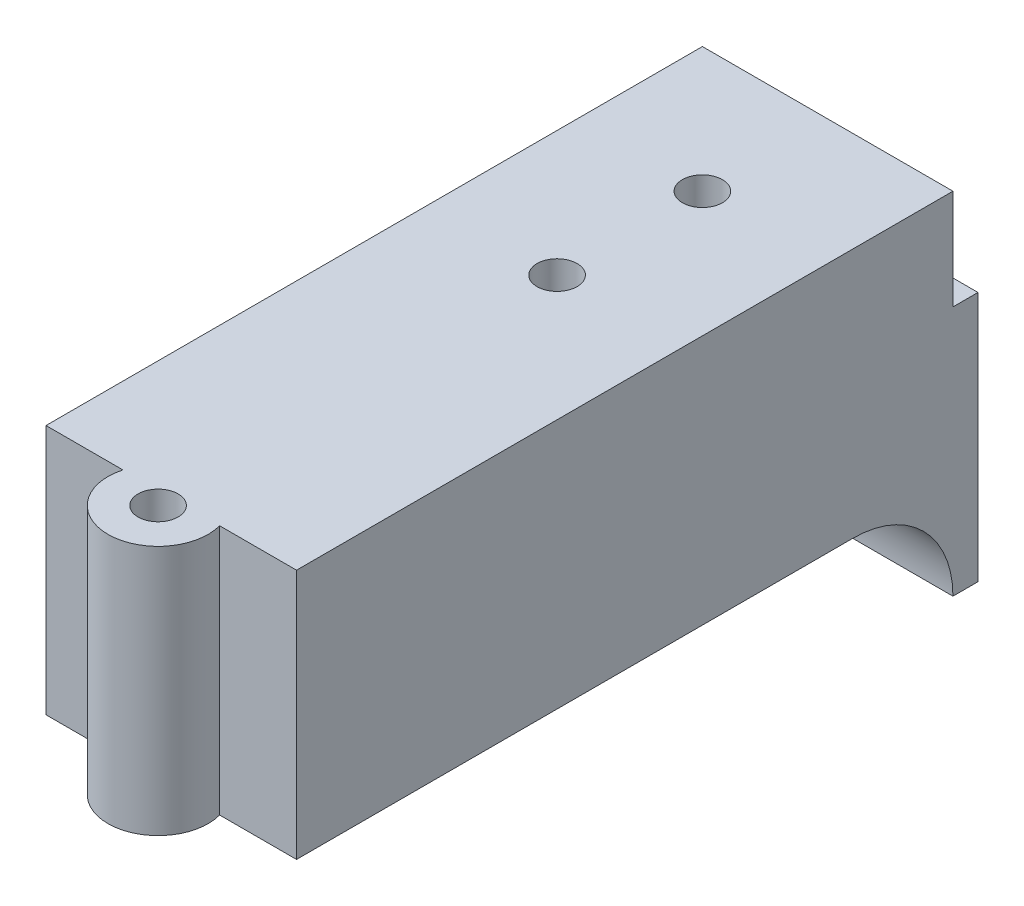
ISO-10303-21;
HEADER;
FILE_DESCRIPTION(('STEP AP214'),'2;1');
FILE_NAME('part.step','',(''),(''),'','','');
FILE_SCHEMA(('AUTOMOTIVE_DESIGN { 1 0 10303 214 1 1 1 1 }'));
ENDSEC;
DATA;
#1=APPLICATION_CONTEXT('core data for automotive mechanical design processes');
#2=APPLICATION_PROTOCOL_DEFINITION('international standard','automotive_design',2000,#1);
#3=PRODUCT_CONTEXT('',#1,'mechanical');
#4=PRODUCT('Part','Part','',(#3));
#5=PRODUCT_RELATED_PRODUCT_CATEGORY('part','',(#4));
#6=PRODUCT_DEFINITION_FORMATION('','',#4);
#7=PRODUCT_DEFINITION_CONTEXT('part definition',#1,'design');
#8=PRODUCT_DEFINITION('design','',#6,#7);
#9=PRODUCT_DEFINITION_SHAPE('','',#8);
#10=(LENGTH_UNIT() NAMED_UNIT(*) SI_UNIT(.MILLI.,.METRE.));
#11=(NAMED_UNIT(*) PLANE_ANGLE_UNIT() SI_UNIT($,.RADIAN.));
#12=(NAMED_UNIT(*) SI_UNIT($,.STERADIAN.) SOLID_ANGLE_UNIT());
#13=UNCERTAINTY_MEASURE_WITH_UNIT(LENGTH_MEASURE(1.E-05),#10,'distance_accuracy_value','');
#14=(GEOMETRIC_REPRESENTATION_CONTEXT(3) GLOBAL_UNCERTAINTY_ASSIGNED_CONTEXT((#13)) GLOBAL_UNIT_ASSIGNED_CONTEXT((#10,
#11,#12)) REPRESENTATION_CONTEXT('',''));
#15=CARTESIAN_POINT('',(0.,0.,0.));
#16=DIRECTION('',(0.,0.,1.));
#17=DIRECTION('',(1.,0.,0.));
#18=AXIS2_PLACEMENT_3D('',#15,#16,#17);
#19=CARTESIAN_POINT('',(25.,50.,58.63));
#20=DIRECTION('',(0.,-1.,0.));
#21=DIRECTION('',(0.,0.,-1.));
#22=AXIS2_PLACEMENT_3D('',#19,#20,#21);
#23=CYLINDRICAL_SURFACE('',#22,4.);
#24=CARTESIAN_POINT('',(25.,50.,58.63));
#25=DIRECTION('',(0.,-1.,0.));
#26=DIRECTION('',(0.,0.,-1.));
#27=AXIS2_PLACEMENT_3D('',#24,#25,#26);
#28=CIRCLE('',#27,4.);
#29=CARTESIAN_POINT('',(25.,50.,54.63));
#30=VERTEX_POINT('',#29);
#31=EDGE_CURVE('E253',#30,#30,#28,.T.);
#32=ORIENTED_EDGE('',*,*,#31,.F.);
#33=EDGE_LOOP('',(#32));
#34=FACE_BOUND('',#33,.T.);
#35=CARTESIAN_POINT('',(25.,10.,58.63));
#36=DIRECTION('',(0.,-1.,0.));
#37=DIRECTION('',(0.,0.,-1.));
#38=AXIS2_PLACEMENT_3D('',#35,#36,#37);
#39=CIRCLE('',#38,4.);
#40=CARTESIAN_POINT('',(25.,10.,54.63));
#41=VERTEX_POINT('',#40);
#42=EDGE_CURVE('E12',#41,#41,#39,.F.);
#43=ORIENTED_EDGE('',*,*,#42,.F.);
#44=EDGE_LOOP('',(#43));
#45=FACE_BOUND('',#44,.T.);
#46=ADVANCED_FACE('F46',(#34,#45),#23,.F.);
#47=CARTESIAN_POINT('',(0.,50.,56.));
#48=DIRECTION('',(0.,0.,-1.));
#49=DIRECTION('',(-1.,0.,0.));
#50=AXIS2_PLACEMENT_3D('',#47,#48,#49);
#51=PLANE('',#50);
#52=DIRECTION('',(1.,0.,0.));
#53=VECTOR('',#52,1.);
#54=CARTESIAN_POINT('',(0.,50.,56.));
#55=LINE('',#54,#53);
#56=CARTESIAN_POINT('',(34.6479583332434,50.,56.));
#57=VERTEX_POINT('',#56);
#58=CARTESIAN_POINT('',(50.,50.,56.));
#59=VERTEX_POINT('',#58);
#60=EDGE_CURVE('E62',#57,#59,#55,.T.);
#61=ORIENTED_EDGE('',*,*,#60,.F.);
#62=DIRECTION('',(0.,-1.,0.));
#63=VECTOR('',#62,1.);
#64=CARTESIAN_POINT('',(34.6479583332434,50.,56.));
#65=LINE('',#64,#63);
#66=CARTESIAN_POINT('',(34.6479583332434,0.,56.));
#67=VERTEX_POINT('',#66);
#68=EDGE_CURVE('E55',#57,#67,#65,.T.);
#69=ORIENTED_EDGE('',*,*,#68,.T.);
#70=DIRECTION('',(1.,0.,0.));
#71=VECTOR('',#70,1.);
#72=CARTESIAN_POINT('',(0.,0.,56.));
#73=LINE('',#72,#71);
#74=CARTESIAN_POINT('',(50.,0.,56.));
#75=VERTEX_POINT('',#74);
#76=EDGE_CURVE('E240',#67,#75,#73,.T.);
#77=ORIENTED_EDGE('',*,*,#76,.T.);
#78=DIRECTION('',(0.,-1.,0.));
#79=VECTOR('',#78,1.);
#80=CARTESIAN_POINT('',(50.,50.,56.));
#81=LINE('',#80,#79);
#82=EDGE_CURVE('E144',#59,#75,#81,.T.);
#83=ORIENTED_EDGE('',*,*,#82,.F.);
#84=EDGE_LOOP('',(#61,#69,#77,#83));
#85=FACE_BOUND('',#84,.T.);
#86=ADVANCED_FACE('F239',(#85),#51,.F.);
#87=CARTESIAN_POINT('',(50.,50.,0.));
#88=DIRECTION('',(1.,0.,0.));
#89=DIRECTION('',(0.,0.,-1.));
#90=AXIS2_PLACEMENT_3D('',#87,#88,#89);
#91=PLANE('',#90);
#92=DIRECTION('',(0.,1.,0.));
#93=VECTOR('',#92,1.);
#94=CARTESIAN_POINT('',(50.,50.,-75.));
#95=LINE('',#94,#93);
#96=CARTESIAN_POINT('',(50.,30.,-75.));
#97=VERTEX_POINT('',#96);
#98=CARTESIAN_POINT('',(50.,50.,-75.));
#99=VERTEX_POINT('',#98);
#100=EDGE_CURVE('E174',#97,#99,#95,.T.);
#101=ORIENTED_EDGE('',*,*,#100,.T.);
#102=DIRECTION('',(0.,0.,1.));
#103=VECTOR('',#102,1.);
#104=CARTESIAN_POINT('',(50.,50.,0.));
#105=LINE('',#104,#103);
#106=EDGE_CURVE('E138',#99,#59,#105,.T.);
#107=ORIENTED_EDGE('',*,*,#106,.T.);
#108=ORIENTED_EDGE('',*,*,#82,.T.);
#109=DIRECTION('',(0.,0.,1.));
#110=VECTOR('',#109,1.);
#111=CARTESIAN_POINT('',(50.,0.,0.));
#112=LINE('',#111,#110);
#113=CARTESIAN_POINT('',(50.,0.,-55.));
#114=VERTEX_POINT('',#113);
#115=EDGE_CURVE('E191',#114,#75,#112,.T.);
#116=ORIENTED_EDGE('',*,*,#115,.F.);
#117=CARTESIAN_POINT('',(50.,-20.,-55.));
#118=DIRECTION('',(1.,0.,0.));
#119=DIRECTION('',(0.,0.,-1.));
#120=AXIS2_PLACEMENT_3D('',#117,#118,#119);
#121=CIRCLE('',#120,20.);
#122=CARTESIAN_POINT('',(50.,-20.,-75.));
#123=VERTEX_POINT('',#122);
#124=EDGE_CURVE('E222',#114,#123,#121,.F.);
#125=ORIENTED_EDGE('',*,*,#124,.T.);
#126=DIRECTION('',(0.,0.,-1.));
#127=VECTOR('',#126,1.);
#128=CARTESIAN_POINT('',(50.,-20.,-80.));
#129=LINE('',#128,#127);
#130=CARTESIAN_POINT('',(50.,-20.,-80.));
#131=VERTEX_POINT('',#130);
#132=EDGE_CURVE('E151',#123,#131,#129,.T.);
#133=ORIENTED_EDGE('',*,*,#132,.T.);
#134=DIRECTION('',(0.,-1.,0.));
#135=VECTOR('',#134,1.);
#136=CARTESIAN_POINT('',(50.,50.,-80.));
#137=LINE('',#136,#135);
#138=CARTESIAN_POINT('',(50.,30.,-80.));
#139=VERTEX_POINT('',#138);
#140=EDGE_CURVE('E215',#139,#131,#137,.T.);
#141=ORIENTED_EDGE('',*,*,#140,.F.);
#142=DIRECTION('',(0.,0.,1.));
#143=VECTOR('',#142,1.);
#144=CARTESIAN_POINT('',(50.,30.,-75.));
#145=LINE('',#144,#143);
#146=EDGE_CURVE('E178',#139,#97,#145,.T.);
#147=ORIENTED_EDGE('',*,*,#146,.T.);
#148=EDGE_LOOP('',(#101,#107,#108,#116,#125,#133,#141,#147));
#149=FACE_BOUND('',#148,.T.);
#150=ADVANCED_FACE('F263',(#149),#91,.T.);
#151=CARTESIAN_POINT('',(0.,50.,-80.));
#152=DIRECTION('',(0.,0.,-1.));
#153=DIRECTION('',(-1.,0.,0.));
#154=AXIS2_PLACEMENT_3D('',#151,#152,#153);
#155=PLANE('',#154);
#156=DIRECTION('',(-1.,0.,0.));
#157=VECTOR('',#156,1.);
#158=CARTESIAN_POINT('',(50.,30.,-80.));
#159=LINE('',#158,#157);
#160=CARTESIAN_POINT('',(0.,30.,-80.));
#161=VERTEX_POINT('',#160);
#162=EDGE_CURVE('E192',#139,#161,#159,.T.);
#163=ORIENTED_EDGE('',*,*,#162,.F.);
#164=ORIENTED_EDGE('',*,*,#140,.T.);
#165=DIRECTION('',(1.,0.,0.));
#166=VECTOR('',#165,1.);
#167=CARTESIAN_POINT('',(0.,-20.,-80.));
#168=LINE('',#167,#166);
#169=CARTESIAN_POINT('',(0.,-20.,-80.));
#170=VERTEX_POINT('',#169);
#171=EDGE_CURVE('E166',#170,#131,#168,.T.);
#172=ORIENTED_EDGE('',*,*,#171,.F.);
#173=DIRECTION('',(0.,-1.,0.));
#174=VECTOR('',#173,1.);
#175=CARTESIAN_POINT('',(0.,50.,-80.));
#176=LINE('',#175,#174);
#177=EDGE_CURVE('E137',#161,#170,#176,.T.);
#178=ORIENTED_EDGE('',*,*,#177,.F.);
#179=EDGE_LOOP('',(#163,#164,#172,#178));
#180=FACE_BOUND('',#179,.T.);
#181=ADVANCED_FACE('F275',(#180),#155,.T.);
#182=CARTESIAN_POINT('',(0.,50.,0.));
#183=DIRECTION('',(1.,0.,0.));
#184=DIRECTION('',(0.,0.,-1.));
#185=AXIS2_PLACEMENT_3D('',#182,#183,#184);
#186=PLANE('',#185);
#187=DIRECTION('',(0.,0.,1.));
#188=VECTOR('',#187,1.);
#189=CARTESIAN_POINT('',(0.,50.,0.));
#190=LINE('',#189,#188);
#191=CARTESIAN_POINT('',(0.,50.,-75.));
#192=VERTEX_POINT('',#191);
#193=CARTESIAN_POINT('',(0.,50.,56.));
#194=VERTEX_POINT('',#193);
#195=EDGE_CURVE('E125',#192,#194,#190,.T.);
#196=ORIENTED_EDGE('',*,*,#195,.F.);
#197=DIRECTION('',(0.,1.,0.));
#198=VECTOR('',#197,1.);
#199=CARTESIAN_POINT('',(0.,50.,-75.));
#200=LINE('',#199,#198);
#201=CARTESIAN_POINT('',(0.,30.,-75.));
#202=VERTEX_POINT('',#201);
#203=EDGE_CURVE('E170',#202,#192,#200,.T.);
#204=ORIENTED_EDGE('',*,*,#203,.F.);
#205=DIRECTION('',(0.,0.,1.));
#206=VECTOR('',#205,1.);
#207=CARTESIAN_POINT('',(0.,30.,-75.));
#208=LINE('',#207,#206);
#209=EDGE_CURVE('E179',#161,#202,#208,.T.);
#210=ORIENTED_EDGE('',*,*,#209,.F.);
#211=ORIENTED_EDGE('',*,*,#177,.T.);
#212=DIRECTION('',(0.,0.,-1.));
#213=VECTOR('',#212,1.);
#214=CARTESIAN_POINT('',(0.,-20.,-80.));
#215=LINE('',#214,#213);
#216=CARTESIAN_POINT('',(0.,-20.,-75.));
#217=VERTEX_POINT('',#216);
#218=EDGE_CURVE('E156',#217,#170,#215,.T.);
#219=ORIENTED_EDGE('',*,*,#218,.F.);
#220=CARTESIAN_POINT('',(0.,-20.,-55.));
#221=DIRECTION('',(1.,0.,0.));
#222=DIRECTION('',(0.,0.,-1.));
#223=AXIS2_PLACEMENT_3D('',#220,#221,#222);
#224=CIRCLE('',#223,20.);
#225=CARTESIAN_POINT('',(0.,0.,-55.));
#226=VERTEX_POINT('',#225);
#227=EDGE_CURVE('E225',#217,#226,#224,.T.);
#228=ORIENTED_EDGE('',*,*,#227,.T.);
#229=DIRECTION('',(0.,0.,1.));
#230=VECTOR('',#229,1.);
#231=CARTESIAN_POINT('',(0.,0.,0.));
#232=LINE('',#231,#230);
#233=CARTESIAN_POINT('',(0.,0.,56.));
#234=VERTEX_POINT('',#233);
#235=EDGE_CURVE('E148',#226,#234,#232,.T.);
#236=ORIENTED_EDGE('',*,*,#235,.T.);
#237=DIRECTION('',(0.,-1.,0.));
#238=VECTOR('',#237,1.);
#239=CARTESIAN_POINT('',(0.,50.,56.));
#240=LINE('',#239,#238);
#241=EDGE_CURVE('E142',#194,#234,#240,.T.);
#242=ORIENTED_EDGE('',*,*,#241,.F.);
#243=EDGE_LOOP('',(#196,#204,#210,#211,#219,#228,#236,#242));
#244=FACE_BOUND('',#243,.T.);
#245=ADVANCED_FACE('F146',(#244),#186,.F.);
#246=CARTESIAN_POINT('',(25.,50.,-50.));
#247=DIRECTION('',(0.,-1.,0.));
#248=DIRECTION('',(0.,0.,-1.));
#249=AXIS2_PLACEMENT_3D('',#246,#247,#248);
#250=CYLINDRICAL_SURFACE('',#249,3.99999999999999);
#251=CARTESIAN_POINT('',(25.,10.,-50.));
#252=DIRECTION('',(0.,1.,0.));
#253=DIRECTION('',(0.,0.,1.));
#254=AXIS2_PLACEMENT_3D('',#251,#252,#253);
#255=CIRCLE('',#254,3.99999999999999);
#256=CARTESIAN_POINT('',(25.,10.,-46.));
#257=VERTEX_POINT('',#256);
#258=EDGE_CURVE('E232',#257,#257,#255,.T.);
#259=ORIENTED_EDGE('',*,*,#258,.F.);
#260=EDGE_LOOP('',(#259));
#261=FACE_BOUND('',#260,.T.);
#262=CARTESIAN_POINT('',(25.,50.,-50.));
#263=DIRECTION('',(0.,1.,0.));
#264=DIRECTION('',(0.,0.,1.));
#265=AXIS2_PLACEMENT_3D('',#262,#263,#264);
#266=CIRCLE('',#265,3.99999999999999);
#267=CARTESIAN_POINT('',(25.,50.,-46.));
#268=VERTEX_POINT('',#267);
#269=EDGE_CURVE('E201',#268,#268,#266,.T.);
#270=ORIENTED_EDGE('',*,*,#269,.T.);
#271=EDGE_LOOP('',(#270));
#272=FACE_BOUND('',#271,.T.);
#273=ADVANCED_FACE('F323',(#261,#272),#250,.F.);
#274=CARTESIAN_POINT('',(25.,50.,-21.));
#275=DIRECTION('',(0.,-1.,0.));
#276=DIRECTION('',(0.,0.,-1.));
#277=AXIS2_PLACEMENT_3D('',#274,#275,#276);
#278=CYLINDRICAL_SURFACE('',#277,4.);
#279=CARTESIAN_POINT('',(25.,10.,-21.));
#280=DIRECTION('',(0.,1.,0.));
#281=DIRECTION('',(0.,0.,1.));
#282=AXIS2_PLACEMENT_3D('',#279,#280,#281);
#283=CIRCLE('',#282,4.);
#284=CARTESIAN_POINT('',(25.,10.,-17.));
#285=VERTEX_POINT('',#284);
#286=EDGE_CURVE('E228',#285,#285,#283,.T.);
#287=ORIENTED_EDGE('',*,*,#286,.F.);
#288=EDGE_LOOP('',(#287));
#289=FACE_BOUND('',#288,.T.);
#290=CARTESIAN_POINT('',(25.,50.,-21.));
#291=DIRECTION('',(0.,1.,0.));
#292=DIRECTION('',(0.,0.,1.));
#293=AXIS2_PLACEMENT_3D('',#290,#291,#292);
#294=CIRCLE('',#293,4.);
#295=CARTESIAN_POINT('',(25.,50.,-17.));
#296=VERTEX_POINT('',#295);
#297=EDGE_CURVE('E197',#296,#296,#294,.T.);
#298=ORIENTED_EDGE('',*,*,#297,.T.);
#299=EDGE_LOOP('',(#298));
#300=FACE_BOUND('',#299,.T.);
#301=ADVANCED_FACE('F317',(#289,#300),#278,.F.);
#302=CARTESIAN_POINT('',(0.,50.,0.));
#303=DIRECTION('',(0.,1.,0.));
#304=DIRECTION('',(0.,0.,1.));
#305=AXIS2_PLACEMENT_3D('',#302,#303,#304);
#306=PLANE('',#305);
#307=ORIENTED_EDGE('',*,*,#31,.T.);
#308=EDGE_LOOP('',(#307));
#309=FACE_BOUND('',#308,.T.);
#310=CARTESIAN_POINT('',(15.3520416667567,50.,56.));
#311=VERTEX_POINT('',#310);
#312=EDGE_CURVE('E129',#194,#311,#55,.T.);
#313=ORIENTED_EDGE('',*,*,#312,.T.);
#314=CARTESIAN_POINT('',(25.,50.,58.63));
#315=DIRECTION('',(0.,-1.,0.));
#316=DIRECTION('',(0.,0.,-1.));
#317=AXIS2_PLACEMENT_3D('',#314,#315,#316);
#318=CIRCLE('',#317,10.);
#319=EDGE_CURVE('E250',#57,#311,#318,.T.);
#320=ORIENTED_EDGE('',*,*,#319,.F.);
#321=ORIENTED_EDGE('',*,*,#60,.T.);
#322=ORIENTED_EDGE('',*,*,#106,.F.);
#323=DIRECTION('',(-1.,0.,0.));
#324=VECTOR('',#323,1.);
#325=CARTESIAN_POINT('',(50.,50.,-75.));
#326=LINE('',#325,#324);
#327=EDGE_CURVE('E132',#99,#192,#326,.T.);
#328=ORIENTED_EDGE('',*,*,#327,.T.);
#329=ORIENTED_EDGE('',*,*,#195,.T.);
#330=EDGE_LOOP('',(#313,#320,#321,#322,#328,#329));
#331=FACE_BOUND('',#330,.T.);
#332=ORIENTED_EDGE('',*,*,#297,.F.);
#333=EDGE_LOOP('',(#332));
#334=FACE_BOUND('',#333,.T.);
#335=ORIENTED_EDGE('',*,*,#269,.F.);
#336=EDGE_LOOP('',(#335));
#337=FACE_BOUND('',#336,.T.);
#338=ADVANCED_FACE('F126',(#309,#331,#334,#337),#306,.T.);
#339=CARTESIAN_POINT('',(0.,0.,0.));
#340=DIRECTION('',(0.,1.,0.));
#341=DIRECTION('',(0.,0.,1.));
#342=AXIS2_PLACEMENT_3D('',#339,#340,#341);
#343=PLANE('',#342);
#344=ORIENTED_EDGE('',*,*,#76,.F.);
#345=CARTESIAN_POINT('',(25.,0.,58.63));
#346=DIRECTION('',(0.,-1.,0.));
#347=DIRECTION('',(0.,0.,-1.));
#348=AXIS2_PLACEMENT_3D('',#345,#346,#347);
#349=CIRCLE('',#348,10.);
#350=CARTESIAN_POINT('',(15.3520416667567,0.,56.));
#351=VERTEX_POINT('',#350);
#352=EDGE_CURVE('E246',#67,#351,#349,.T.);
#353=ORIENTED_EDGE('',*,*,#352,.T.);
#354=EDGE_CURVE('E249',#234,#351,#73,.T.);
#355=ORIENTED_EDGE('',*,*,#354,.F.);
#356=ORIENTED_EDGE('',*,*,#235,.F.);
#357=DIRECTION('',(1.,0.,0.));
#358=VECTOR('',#357,1.);
#359=CARTESIAN_POINT('',(0.,0.,-55.));
#360=LINE('',#359,#358);
#361=EDGE_CURVE('E218',#226,#114,#360,.T.);
#362=ORIENTED_EDGE('',*,*,#361,.T.);
#363=ORIENTED_EDGE('',*,*,#115,.T.);
#364=EDGE_LOOP('',(#344,#353,#355,#356,#362,#363));
#365=FACE_BOUND('',#364,.T.);
#366=ADVANCED_FACE('F245',(#365),#343,.F.);
#367=CARTESIAN_POINT('',(50.,50.,-75.));
#368=DIRECTION('',(0.,0.,1.));
#369=DIRECTION('',(1.,0.,0.));
#370=AXIS2_PLACEMENT_3D('',#367,#368,#369);
#371=PLANE('',#370);
#372=ORIENTED_EDGE('',*,*,#203,.T.);
#373=ORIENTED_EDGE('',*,*,#327,.F.);
#374=ORIENTED_EDGE('',*,*,#100,.F.);
#375=DIRECTION('',(-1.,0.,0.));
#376=VECTOR('',#375,1.);
#377=CARTESIAN_POINT('',(50.,30.,-75.));
#378=LINE('',#377,#376);
#379=EDGE_CURVE('E188',#97,#202,#378,.T.);
#380=ORIENTED_EDGE('',*,*,#379,.T.);
#381=EDGE_LOOP('',(#372,#373,#374,#380));
#382=FACE_BOUND('',#381,.T.);
#383=ADVANCED_FACE('F267',(#382),#371,.F.);
#384=CARTESIAN_POINT('',(50.,30.,-75.));
#385=DIRECTION('',(0.,-1.,0.));
#386=DIRECTION('',(0.,0.,-1.));
#387=AXIS2_PLACEMENT_3D('',#384,#385,#386);
#388=PLANE('',#387);
#389=ORIENTED_EDGE('',*,*,#209,.T.);
#390=ORIENTED_EDGE('',*,*,#379,.F.);
#391=ORIENTED_EDGE('',*,*,#146,.F.);
#392=ORIENTED_EDGE('',*,*,#162,.T.);
#393=EDGE_LOOP('',(#389,#390,#391,#392));
#394=FACE_BOUND('',#393,.T.);
#395=ADVANCED_FACE('F291',(#394),#388,.F.);
#396=CARTESIAN_POINT('',(0.,-20.,-80.));
#397=DIRECTION('',(0.,-1.,0.));
#398=DIRECTION('',(0.,0.,-1.));
#399=AXIS2_PLACEMENT_3D('',#396,#397,#398);
#400=PLANE('',#399);
#401=ORIENTED_EDGE('',*,*,#132,.F.);
#402=DIRECTION('',(1.,0.,0.));
#403=VECTOR('',#402,1.);
#404=CARTESIAN_POINT('',(0.,-20.,-75.));
#405=LINE('',#404,#403);
#406=EDGE_CURVE('E164',#217,#123,#405,.T.);
#407=ORIENTED_EDGE('',*,*,#406,.F.);
#408=ORIENTED_EDGE('',*,*,#218,.T.);
#409=ORIENTED_EDGE('',*,*,#171,.T.);
#410=EDGE_LOOP('',(#401,#407,#408,#409));
#411=FACE_BOUND('',#410,.T.);
#412=ADVANCED_FACE('F278',(#411),#400,.T.);
#413=CARTESIAN_POINT('',(0.,-20.,-55.));
#414=DIRECTION('',(1.,0.,0.));
#415=DIRECTION('',(0.,0.,-1.));
#416=AXIS2_PLACEMENT_3D('',#413,#414,#415);
#417=CYLINDRICAL_SURFACE('',#416,20.);
#418=ORIENTED_EDGE('',*,*,#227,.F.);
#419=ORIENTED_EDGE('',*,*,#406,.T.);
#420=ORIENTED_EDGE('',*,*,#124,.F.);
#421=ORIENTED_EDGE('',*,*,#361,.F.);
#422=EDGE_LOOP('',(#418,#419,#420,#421));
#423=FACE_BOUND('',#422,.T.);
#424=ADVANCED_FACE('F48',(#423),#417,.F.);
#425=CARTESIAN_POINT('',(0.,10.,0.));
#426=DIRECTION('',(0.,1.,0.));
#427=DIRECTION('',(0.,0.,1.));
#428=AXIS2_PLACEMENT_3D('',#425,#426,#427);
#429=PLANE('',#428);
#430=ORIENTED_EDGE('',*,*,#286,.T.);
#431=EDGE_LOOP('',(#430));
#432=FACE_BOUND('',#431,.T.);
#433=ADVANCED_FACE('F283',(#432),#429,.T.);
#434=CARTESIAN_POINT('',(0.,10.,0.));
#435=DIRECTION('',(0.,1.,0.));
#436=DIRECTION('',(0.,0.,1.));
#437=AXIS2_PLACEMENT_3D('',#434,#435,#436);
#438=PLANE('',#437);
#439=ORIENTED_EDGE('',*,*,#258,.T.);
#440=EDGE_LOOP('',(#439));
#441=FACE_BOUND('',#440,.T.);
#442=ADVANCED_FACE('F288',(#441),#438,.T.);
#443=ORIENTED_EDGE('',*,*,#354,.T.);
#444=DIRECTION('',(0.,-1.,0.));
#445=VECTOR('',#444,1.);
#446=CARTESIAN_POINT('',(15.3520416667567,50.,56.));
#447=LINE('',#446,#445);
#448=EDGE_CURVE('E70',#351,#311,#447,.F.);
#449=ORIENTED_EDGE('',*,*,#448,.T.);
#450=ORIENTED_EDGE('',*,*,#312,.F.);
#451=ORIENTED_EDGE('',*,*,#241,.T.);
#452=EDGE_LOOP('',(#443,#449,#450,#451));
#453=FACE_BOUND('',#452,.T.);
#454=ADVANCED_FACE('F141',(#453),#51,.F.);
#455=CARTESIAN_POINT('',(25.,50.,58.63));
#456=DIRECTION('',(0.,-1.,0.));
#457=DIRECTION('',(0.,0.,-1.));
#458=AXIS2_PLACEMENT_3D('',#455,#456,#457);
#459=CYLINDRICAL_SURFACE('',#458,10.);
#460=ORIENTED_EDGE('',*,*,#68,.F.);
#461=ORIENTED_EDGE('',*,*,#319,.T.);
#462=ORIENTED_EDGE('',*,*,#448,.F.);
#463=ORIENTED_EDGE('',*,*,#352,.F.);
#464=EDGE_LOOP('',(#460,#461,#462,#463));
#465=FACE_BOUND('',#464,.T.);
#466=ADVANCED_FACE('F251',(#465),#459,.T.);
#467=CARTESIAN_POINT('',(0.,10.,0.));
#468=DIRECTION('',(0.,-1.,0.));
#469=DIRECTION('',(0.,0.,-1.));
#470=AXIS2_PLACEMENT_3D('',#467,#468,#469);
#471=PLANE('',#470);
#472=ORIENTED_EDGE('',*,*,#42,.T.);
#473=EDGE_LOOP('',(#472));
#474=FACE_BOUND('',#473,.T.);
#475=ADVANCED_FACE('F304',(#474),#471,.F.);
#476=CLOSED_SHELL('',(#46,#86,#150,#181,#245,#273,#301,#338,#366,#383,#395,#412,#424,#433,#442,
#454,#466,#475));
#477=MANIFOLD_SOLID_BREP('B2',#476);
#478=ADVANCED_BREP_SHAPE_REPRESENTATION('',(#18,#477),#14);
#479=SHAPE_DEFINITION_REPRESENTATION(#9,#478);
ENDSEC;
END-ISO-10303-21;
